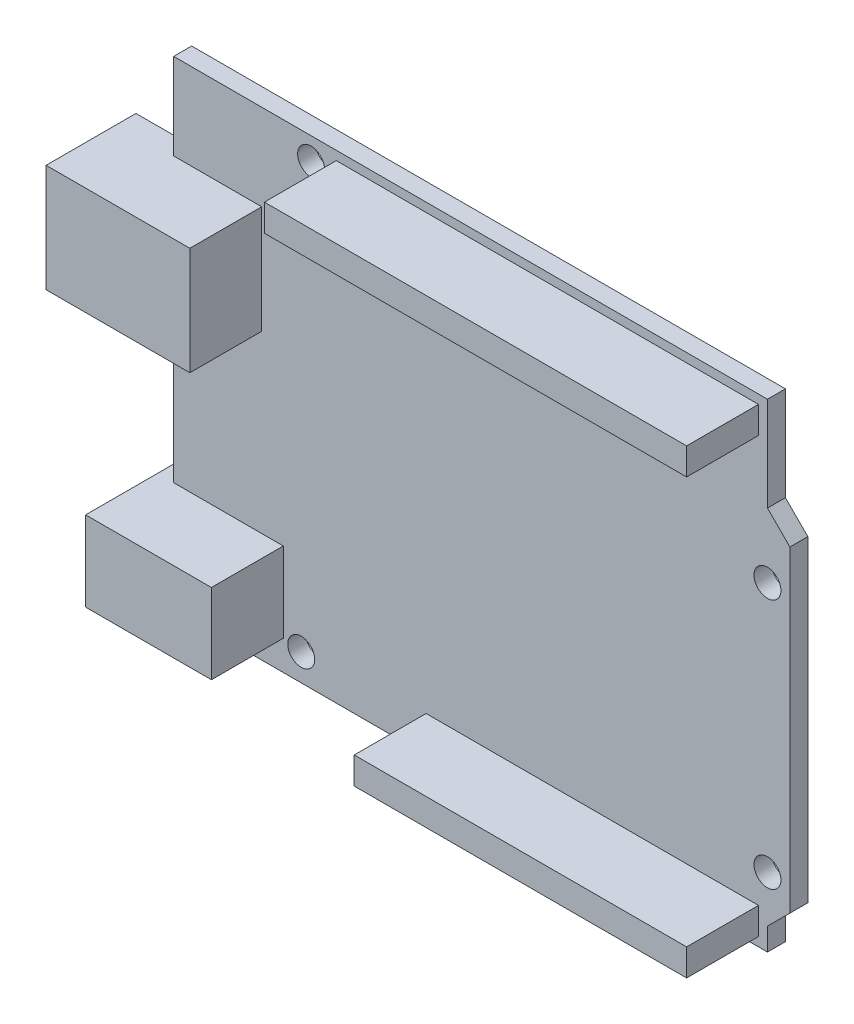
ISO-10303-21;
HEADER;
FILE_DESCRIPTION(('STEP AP214'),'2;1');
FILE_NAME('part.step','',(''),(''),'','','');
FILE_SCHEMA(('AUTOMOTIVE_DESIGN { 1 0 10303 214 1 1 1 1 }'));
ENDSEC;
DATA;
#1=APPLICATION_CONTEXT('core data for automotive mechanical design processes');
#2=APPLICATION_PROTOCOL_DEFINITION('international standard','automotive_design',2000,#1);
#3=PRODUCT_CONTEXT('',#1,'mechanical');
#4=PRODUCT('Part','Part','',(#3));
#5=PRODUCT_RELATED_PRODUCT_CATEGORY('part','',(#4));
#6=PRODUCT_DEFINITION_FORMATION('','',#4);
#7=PRODUCT_DEFINITION_CONTEXT('part definition',#1,'design');
#8=PRODUCT_DEFINITION('design','',#6,#7);
#9=PRODUCT_DEFINITION_SHAPE('','',#8);
#10=(LENGTH_UNIT() NAMED_UNIT(*) SI_UNIT(.MILLI.,.METRE.));
#11=(NAMED_UNIT(*) PLANE_ANGLE_UNIT() SI_UNIT($,.RADIAN.));
#12=(NAMED_UNIT(*) SI_UNIT($,.STERADIAN.) SOLID_ANGLE_UNIT());
#13=UNCERTAINTY_MEASURE_WITH_UNIT(LENGTH_MEASURE(1.E-05),#10,'distance_accuracy_value','');
#14=(GEOMETRIC_REPRESENTATION_CONTEXT(3) GLOBAL_UNCERTAINTY_ASSIGNED_CONTEXT((#13)) GLOBAL_UNIT_ASSIGNED_CONTEXT((#10,
#11,#12)) REPRESENTATION_CONTEXT('',''));
#15=CARTESIAN_POINT('',(0.,0.,0.));
#16=DIRECTION('',(0.,0.,1.));
#17=DIRECTION('',(1.,0.,0.));
#18=AXIS2_PLACEMENT_3D('',#15,#16,#17);
#19=CARTESIAN_POINT('',(-34.3,0.,2.));
#20=DIRECTION('',(1.,0.,0.));
#21=DIRECTION('',(0.,0.,-1.));
#22=AXIS2_PLACEMENT_3D('',#19,#20,#21);
#23=PLANE('',#22);
#24=DIRECTION('',(0.,-1.,0.));
#25=VECTOR('',#24,1.);
#26=CARTESIAN_POINT('',(-34.3,0.,0.));
#27=LINE('',#26,#25);
#28=CARTESIAN_POINT('',(-34.3,-23.35,0.));
#29=VERTEX_POINT('',#28);
#30=CARTESIAN_POINT('',(-34.3,-26.65,0.));
#31=VERTEX_POINT('',#30);
#32=EDGE_CURVE('E343',#29,#31,#27,.T.);
#33=ORIENTED_EDGE('',*,*,#32,.T.);
#34=DIRECTION('',(0.,0.,-1.));
#35=VECTOR('',#34,1.);
#36=CARTESIAN_POINT('',(-34.3,-26.65,2.));
#37=LINE('',#36,#35);
#38=CARTESIAN_POINT('',(-34.3,-26.65,2.));
#39=VERTEX_POINT('',#38);
#40=EDGE_CURVE('E48',#39,#31,#37,.T.);
#41=ORIENTED_EDGE('',*,*,#40,.F.);
#42=DIRECTION('',(0.,-1.,0.));
#43=VECTOR('',#42,1.);
#44=CARTESIAN_POINT('',(-34.3,0.,2.));
#45=LINE('',#44,#43);
#46=CARTESIAN_POINT('',(-34.3,-23.35,2.));
#47=VERTEX_POINT('',#46);
#48=EDGE_CURVE('E286',#47,#39,#45,.T.);
#49=ORIENTED_EDGE('',*,*,#48,.F.);
#50=DIRECTION('',(0.,0.,-1.));
#51=VECTOR('',#50,1.);
#52=CARTESIAN_POINT('',(-34.3,-23.35,2.));
#53=LINE('',#52,#51);
#54=EDGE_CURVE('E11',#47,#29,#53,.T.);
#55=ORIENTED_EDGE('',*,*,#54,.T.);
#56=EDGE_LOOP('',(#33,#41,#49,#55));
#57=FACE_BOUND('',#56,.T.);
#58=ADVANCED_FACE('F39',(#57),#23,.F.);
#59=CARTESIAN_POINT('',(0.,-26.65,2.));
#60=DIRECTION('',(0.,1.,0.));
#61=DIRECTION('',(-1.,0.,0.));
#62=AXIS2_PLACEMENT_3D('',#59,#60,#61);
#63=PLANE('',#62);
#64=DIRECTION('',(1.,0.,0.));
#65=VECTOR('',#64,1.);
#66=CARTESIAN_POINT('',(0.,-26.65,0.));
#67=LINE('',#66,#65);
#68=CARTESIAN_POINT('',(31.8,-26.65,0.));
#69=VERTEX_POINT('',#68);
#70=EDGE_CURVE('E346',#31,#69,#67,.T.);
#71=ORIENTED_EDGE('',*,*,#70,.T.);
#72=DIRECTION('',(0.,0.,-1.));
#73=VECTOR('',#72,1.);
#74=CARTESIAN_POINT('',(31.8,-26.65,2.));
#75=LINE('',#74,#73);
#76=CARTESIAN_POINT('',(31.8,-26.65,2.));
#77=VERTEX_POINT('',#76);
#78=EDGE_CURVE('E386',#77,#69,#75,.T.);
#79=ORIENTED_EDGE('',*,*,#78,.F.);
#80=DIRECTION('',(1.,0.,0.));
#81=VECTOR('',#80,1.);
#82=CARTESIAN_POINT('',(0.,-26.65,2.));
#83=LINE('',#82,#81);
#84=EDGE_CURVE('E109',#39,#77,#83,.T.);
#85=ORIENTED_EDGE('',*,*,#84,.F.);
#86=ORIENTED_EDGE('',*,*,#40,.T.);
#87=EDGE_LOOP('',(#71,#79,#85,#86));
#88=FACE_BOUND('',#87,.T.);
#89=ADVANCED_FACE('F388',(#88),#63,.F.);
#90=CARTESIAN_POINT('',(31.7999999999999,1.76525460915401E-13,2.));
#91=DIRECTION('',(1.,0.,0.));
#92=DIRECTION('',(0.,1.,0.));
#93=AXIS2_PLACEMENT_3D('',#90,#91,#92);
#94=PLANE('',#93);
#95=DIRECTION('',(0.,-1.,0.));
#96=VECTOR('',#95,1.);
#97=CARTESIAN_POINT('',(31.7999999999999,1.76525460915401E-13,0.));
#98=LINE('',#97,#96);
#99=CARTESIAN_POINT('',(31.8,-24.15,0.));
#100=VERTEX_POINT('',#99);
#101=EDGE_CURVE('E350',#100,#69,#98,.T.);
#102=ORIENTED_EDGE('',*,*,#101,.F.);
#103=DIRECTION('',(0.,0.,-1.));
#104=VECTOR('',#103,1.);
#105=CARTESIAN_POINT('',(31.8,-24.15,2.));
#106=LINE('',#105,#104);
#107=CARTESIAN_POINT('',(31.8,-24.15,2.));
#108=VERTEX_POINT('',#107);
#109=EDGE_CURVE('E384',#108,#100,#106,.T.);
#110=ORIENTED_EDGE('',*,*,#109,.F.);
#111=DIRECTION('',(0.,-1.,0.));
#112=VECTOR('',#111,1.);
#113=CARTESIAN_POINT('',(31.7999999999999,1.76525460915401E-13,2.));
#114=LINE('',#113,#112);
#115=EDGE_CURVE('E291',#108,#77,#114,.T.);
#116=ORIENTED_EDGE('',*,*,#115,.T.);
#117=ORIENTED_EDGE('',*,*,#78,.T.);
#118=EDGE_LOOP('',(#102,#110,#116,#117));
#119=FACE_BOUND('',#118,.T.);
#120=ADVANCED_FACE('F504',(#119),#94,.T.);
#121=CARTESIAN_POINT('',(27.9750000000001,-27.9749999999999,2.));
#122=DIRECTION('',(0.707106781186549,-0.707106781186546,0.));
#123=DIRECTION('',(0.707106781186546,0.707106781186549,0.));
#124=AXIS2_PLACEMENT_3D('',#121,#122,#123);
#125=PLANE('',#124);
#126=DIRECTION('',(-0.707106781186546,-0.707106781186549,0.));
#127=VECTOR('',#126,1.);
#128=CARTESIAN_POINT('',(27.9750000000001,-27.9749999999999,0.));
#129=LINE('',#128,#127);
#130=CARTESIAN_POINT('',(34.3,-21.65,0.));
#131=VERTEX_POINT('',#130);
#132=EDGE_CURVE('E353',#131,#100,#129,.T.);
#133=ORIENTED_EDGE('',*,*,#132,.F.);
#134=DIRECTION('',(0.,0.,-1.));
#135=VECTOR('',#134,1.);
#136=CARTESIAN_POINT('',(34.3,-21.65,2.));
#137=LINE('',#136,#135);
#138=CARTESIAN_POINT('',(34.3,-21.65,2.));
#139=VERTEX_POINT('',#138);
#140=EDGE_CURVE('E382',#139,#131,#137,.T.);
#141=ORIENTED_EDGE('',*,*,#140,.F.);
#142=DIRECTION('',(-0.707106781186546,-0.707106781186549,0.));
#143=VECTOR('',#142,1.);
#144=CARTESIAN_POINT('',(27.9750000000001,-27.9749999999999,2.));
#145=LINE('',#144,#143);
#146=EDGE_CURVE('E294',#139,#108,#145,.T.);
#147=ORIENTED_EDGE('',*,*,#146,.T.);
#148=ORIENTED_EDGE('',*,*,#109,.T.);
#149=EDGE_LOOP('',(#133,#141,#147,#148));
#150=FACE_BOUND('',#149,.T.);
#151=ADVANCED_FACE('F501',(#150),#125,.T.);
#152=CARTESIAN_POINT('',(34.3,0.,2.));
#153=DIRECTION('',(1.,0.,0.));
#154=DIRECTION('',(0.,0.,-1.));
#155=AXIS2_PLACEMENT_3D('',#152,#153,#154);
#156=PLANE('',#155);
#157=DIRECTION('',(0.,-1.,0.));
#158=VECTOR('',#157,1.);
#159=CARTESIAN_POINT('',(34.3,0.,0.));
#160=LINE('',#159,#158);
#161=CARTESIAN_POINT('',(34.3,13.65,0.));
#162=VERTEX_POINT('',#161);
#163=EDGE_CURVE('E356',#162,#131,#160,.T.);
#164=ORIENTED_EDGE('',*,*,#163,.F.);
#165=DIRECTION('',(0.,0.,-1.));
#166=VECTOR('',#165,1.);
#167=CARTESIAN_POINT('',(34.3,13.65,2.));
#168=LINE('',#167,#166);
#169=CARTESIAN_POINT('',(34.3,13.65,2.));
#170=VERTEX_POINT('',#169);
#171=EDGE_CURVE('E380',#170,#162,#168,.T.);
#172=ORIENTED_EDGE('',*,*,#171,.F.);
#173=DIRECTION('',(0.,-1.,0.));
#174=VECTOR('',#173,1.);
#175=CARTESIAN_POINT('',(34.3,0.,2.));
#176=LINE('',#175,#174);
#177=EDGE_CURVE('E297',#170,#139,#176,.T.);
#178=ORIENTED_EDGE('',*,*,#177,.T.);
#179=ORIENTED_EDGE('',*,*,#140,.T.);
#180=EDGE_LOOP('',(#164,#172,#178,#179));
#181=FACE_BOUND('',#180,.T.);
#182=ADVANCED_FACE('F497',(#181),#156,.T.);
#183=CARTESIAN_POINT('',(23.9749999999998,23.9750000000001,2.));
#184=DIRECTION('',(0.707106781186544,0.707106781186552,0.));
#185=DIRECTION('',(-0.707106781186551,0.707106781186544,0.));
#186=AXIS2_PLACEMENT_3D('',#183,#184,#185);
#187=PLANE('',#186);
#188=DIRECTION('',(0.707106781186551,-0.707106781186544,0.));
#189=VECTOR('',#188,1.);
#190=CARTESIAN_POINT('',(23.9749999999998,23.9750000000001,0.));
#191=LINE('',#190,#189);
#192=CARTESIAN_POINT('',(31.8,16.15,0.));
#193=VERTEX_POINT('',#192);
#194=EDGE_CURVE('E359',#193,#162,#191,.T.);
#195=ORIENTED_EDGE('',*,*,#194,.F.);
#196=DIRECTION('',(0.,0.,-1.));
#197=VECTOR('',#196,1.);
#198=CARTESIAN_POINT('',(31.8,16.15,2.));
#199=LINE('',#198,#197);
#200=CARTESIAN_POINT('',(31.8,16.15,2.));
#201=VERTEX_POINT('',#200);
#202=EDGE_CURVE('E378',#201,#193,#199,.T.);
#203=ORIENTED_EDGE('',*,*,#202,.F.);
#204=DIRECTION('',(0.707106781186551,-0.707106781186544,0.));
#205=VECTOR('',#204,1.);
#206=CARTESIAN_POINT('',(23.9749999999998,23.9750000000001,2.));
#207=LINE('',#206,#205);
#208=EDGE_CURVE('E300',#201,#170,#207,.T.);
#209=ORIENTED_EDGE('',*,*,#208,.T.);
#210=ORIENTED_EDGE('',*,*,#171,.T.);
#211=EDGE_LOOP('',(#195,#203,#209,#210));
#212=FACE_BOUND('',#211,.T.);
#213=ADVANCED_FACE('F493',(#212),#187,.T.);
#214=CARTESIAN_POINT('',(31.8,0.,2.));
#215=DIRECTION('',(1.,0.,0.));
#216=DIRECTION('',(0.,0.,-1.));
#217=AXIS2_PLACEMENT_3D('',#214,#215,#216);
#218=PLANE('',#217);
#219=DIRECTION('',(0.,-1.,0.));
#220=VECTOR('',#219,1.);
#221=CARTESIAN_POINT('',(31.8,0.,0.));
#222=LINE('',#221,#220);
#223=CARTESIAN_POINT('',(31.8,26.65,0.));
#224=VERTEX_POINT('',#223);
#225=EDGE_CURVE('E362',#224,#193,#222,.T.);
#226=ORIENTED_EDGE('',*,*,#225,.F.);
#227=DIRECTION('',(0.,0.,-1.));
#228=VECTOR('',#227,1.);
#229=CARTESIAN_POINT('',(31.8,26.65,2.));
#230=LINE('',#229,#228);
#231=CARTESIAN_POINT('',(31.8,26.65,2.));
#232=VERTEX_POINT('',#231);
#233=EDGE_CURVE('E376',#232,#224,#230,.T.);
#234=ORIENTED_EDGE('',*,*,#233,.F.);
#235=DIRECTION('',(0.,-1.,0.));
#236=VECTOR('',#235,1.);
#237=CARTESIAN_POINT('',(31.8,0.,2.));
#238=LINE('',#237,#236);
#239=EDGE_CURVE('E303',#232,#201,#238,.T.);
#240=ORIENTED_EDGE('',*,*,#239,.T.);
#241=ORIENTED_EDGE('',*,*,#202,.T.);
#242=EDGE_LOOP('',(#226,#234,#240,#241));
#243=FACE_BOUND('',#242,.T.);
#244=ADVANCED_FACE('F489',(#243),#218,.T.);
#245=CARTESIAN_POINT('',(0.,26.65,2.));
#246=DIRECTION('',(0.,1.,0.));
#247=DIRECTION('',(-1.,0.,0.));
#248=AXIS2_PLACEMENT_3D('',#245,#246,#247);
#249=PLANE('',#248);
#250=DIRECTION('',(1.,0.,0.));
#251=VECTOR('',#250,1.);
#252=CARTESIAN_POINT('',(0.,26.65,0.));
#253=LINE('',#252,#251);
#254=CARTESIAN_POINT('',(-34.3,26.65,0.));
#255=VERTEX_POINT('',#254);
#256=EDGE_CURVE('E365',#255,#224,#253,.T.);
#257=ORIENTED_EDGE('',*,*,#256,.F.);
#258=DIRECTION('',(0.,0.,-1.));
#259=VECTOR('',#258,1.);
#260=CARTESIAN_POINT('',(-34.3,26.65,2.));
#261=LINE('',#260,#259);
#262=CARTESIAN_POINT('',(-34.3,26.65,2.));
#263=VERTEX_POINT('',#262);
#264=EDGE_CURVE('E374',#263,#255,#261,.T.);
#265=ORIENTED_EDGE('',*,*,#264,.F.);
#266=DIRECTION('',(1.,0.,0.));
#267=VECTOR('',#266,1.);
#268=CARTESIAN_POINT('',(0.,26.65,2.));
#269=LINE('',#268,#267);
#270=EDGE_CURVE('E306',#263,#232,#269,.T.);
#271=ORIENTED_EDGE('',*,*,#270,.T.);
#272=ORIENTED_EDGE('',*,*,#233,.T.);
#273=EDGE_LOOP('',(#257,#265,#271,#272));
#274=FACE_BOUND('',#273,.T.);
#275=ADVANCED_FACE('F484',(#274),#249,.T.);
#276=CARTESIAN_POINT('',(-34.3,17.05,0.));
#277=VERTEX_POINT('',#276);
#278=EDGE_CURVE('E347',#255,#277,#27,.T.);
#279=ORIENTED_EDGE('',*,*,#278,.T.);
#280=DIRECTION('',(0.,0.,-1.));
#281=VECTOR('',#280,1.);
#282=CARTESIAN_POINT('',(-34.3,17.05,2.));
#283=LINE('',#282,#281);
#284=CARTESIAN_POINT('',(-34.3,17.05,2.));
#285=VERTEX_POINT('',#284);
#286=EDGE_CURVE('E372',#285,#277,#283,.T.);
#287=ORIENTED_EDGE('',*,*,#286,.F.);
#288=EDGE_CURVE('E289',#263,#285,#45,.T.);
#289=ORIENTED_EDGE('',*,*,#288,.F.);
#290=ORIENTED_EDGE('',*,*,#264,.T.);
#291=EDGE_LOOP('',(#279,#287,#289,#290));
#292=FACE_BOUND('',#291,.T.);
#293=ADVANCED_FACE('F480',(#292),#23,.F.);
#294=CARTESIAN_POINT('',(-34.3,5.04999999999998,0.));
#295=VERTEX_POINT('',#294);
#296=CARTESIAN_POINT('',(-34.3,-14.45,0.));
#297=VERTEX_POINT('',#296);
#298=EDGE_CURVE('E268',#295,#297,#27,.T.);
#299=ORIENTED_EDGE('',*,*,#298,.T.);
#300=DIRECTION('',(0.,0.,-1.));
#301=VECTOR('',#300,1.);
#302=CARTESIAN_POINT('',(-34.3,-14.45,2.));
#303=LINE('',#302,#301);
#304=CARTESIAN_POINT('',(-34.3,-14.45,2.));
#305=VERTEX_POINT('',#304);
#306=EDGE_CURVE('E331',#305,#297,#303,.T.);
#307=ORIENTED_EDGE('',*,*,#306,.F.);
#308=CARTESIAN_POINT('',(-34.3,5.04999999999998,2.));
#309=VERTEX_POINT('',#308);
#310=EDGE_CURVE('E288',#309,#305,#45,.T.);
#311=ORIENTED_EDGE('',*,*,#310,.F.);
#312=DIRECTION('',(0.,0.,-1.));
#313=VECTOR('',#312,1.);
#314=CARTESIAN_POINT('',(-34.3,5.04999999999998,2.));
#315=LINE('',#314,#313);
#316=EDGE_CURVE('E369',#309,#295,#315,.T.);
#317=ORIENTED_EDGE('',*,*,#316,.T.);
#318=EDGE_LOOP('',(#299,#307,#311,#317));
#319=FACE_BOUND('',#318,.T.);
#320=ADVANCED_FACE('F455',(#319),#23,.F.);
#321=CARTESIAN_POINT('',(-19.,24.15,2.));
#322=DIRECTION('',(0.,0.,-1.));
#323=DIRECTION('',(-1.,0.,0.));
#324=AXIS2_PLACEMENT_3D('',#321,#322,#323);
#325=CYLINDRICAL_SURFACE('',#324,1.5);
#326=CARTESIAN_POINT('',(-19.,24.15,2.));
#327=DIRECTION('',(0.,0.,1.));
#328=DIRECTION('',(1.,0.,0.));
#329=AXIS2_PLACEMENT_3D('',#326,#327,#328);
#330=CIRCLE('',#329,1.5);
#331=CARTESIAN_POINT('',(-17.5,24.15,2.));
#332=VERTEX_POINT('',#331);
#333=EDGE_CURVE('E274',#332,#332,#330,.T.);
#334=ORIENTED_EDGE('',*,*,#333,.T.);
#335=EDGE_LOOP('',(#334));
#336=FACE_BOUND('',#335,.T.);
#337=CARTESIAN_POINT('',(-19.,24.15,0.));
#338=DIRECTION('',(0.,0.,1.));
#339=DIRECTION('',(1.,0.,0.));
#340=AXIS2_PLACEMENT_3D('',#337,#338,#339);
#341=CIRCLE('',#340,1.5);
#342=CARTESIAN_POINT('',(-17.5,24.15,0.));
#343=VERTEX_POINT('',#342);
#344=EDGE_CURVE('E340',#343,#343,#341,.T.);
#345=ORIENTED_EDGE('',*,*,#344,.F.);
#346=EDGE_LOOP('',(#345));
#347=FACE_BOUND('',#346,.T.);
#348=ADVANCED_FACE('F562',(#336,#347),#325,.F.);
#349=CARTESIAN_POINT('',(31.8,8.94999999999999,2.));
#350=DIRECTION('',(0.,0.,-1.));
#351=DIRECTION('',(-1.,0.,0.));
#352=AXIS2_PLACEMENT_3D('',#349,#350,#351);
#353=CYLINDRICAL_SURFACE('',#352,1.5);
#354=CARTESIAN_POINT('',(31.8,8.94999999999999,2.));
#355=DIRECTION('',(0.,0.,1.));
#356=DIRECTION('',(1.,0.,0.));
#357=AXIS2_PLACEMENT_3D('',#354,#355,#356);
#358=CIRCLE('',#357,1.5);
#359=CARTESIAN_POINT('',(33.3,8.94999999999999,2.));
#360=VERTEX_POINT('',#359);
#361=EDGE_CURVE('E271',#360,#360,#358,.T.);
#362=ORIENTED_EDGE('',*,*,#361,.T.);
#363=EDGE_LOOP('',(#362));
#364=FACE_BOUND('',#363,.T.);
#365=CARTESIAN_POINT('',(31.8,8.94999999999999,0.));
#366=DIRECTION('',(0.,0.,1.));
#367=DIRECTION('',(1.,0.,0.));
#368=AXIS2_PLACEMENT_3D('',#365,#366,#367);
#369=CIRCLE('',#368,1.5);
#370=CARTESIAN_POINT('',(33.3,8.94999999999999,0.));
#371=VERTEX_POINT('',#370);
#372=EDGE_CURVE('E337',#371,#371,#369,.T.);
#373=ORIENTED_EDGE('',*,*,#372,.F.);
#374=EDGE_LOOP('',(#373));
#375=FACE_BOUND('',#374,.T.);
#376=ADVANCED_FACE('F567',(#364,#375),#353,.F.);
#377=CARTESIAN_POINT('',(31.8,-18.95,2.));
#378=DIRECTION('',(0.,0.,-1.));
#379=DIRECTION('',(-1.,0.,0.));
#380=AXIS2_PLACEMENT_3D('',#377,#378,#379);
#381=CYLINDRICAL_SURFACE('',#380,1.5);
#382=CARTESIAN_POINT('',(31.8,-18.95,2.));
#383=DIRECTION('',(0.,0.,1.));
#384=DIRECTION('',(1.,0.,0.));
#385=AXIS2_PLACEMENT_3D('',#382,#383,#384);
#386=CIRCLE('',#385,1.5);
#387=CARTESIAN_POINT('',(33.3,-18.95,2.));
#388=VERTEX_POINT('',#387);
#389=EDGE_CURVE('E267',#388,#388,#386,.T.);
#390=ORIENTED_EDGE('',*,*,#389,.T.);
#391=EDGE_LOOP('',(#390));
#392=FACE_BOUND('',#391,.T.);
#393=CARTESIAN_POINT('',(31.8,-18.95,0.));
#394=DIRECTION('',(0.,0.,1.));
#395=DIRECTION('',(1.,0.,0.));
#396=AXIS2_PLACEMENT_3D('',#393,#394,#395);
#397=CIRCLE('',#396,1.5);
#398=CARTESIAN_POINT('',(33.3,-18.95,0.));
#399=VERTEX_POINT('',#398);
#400=EDGE_CURVE('E334',#399,#399,#397,.T.);
#401=ORIENTED_EDGE('',*,*,#400,.F.);
#402=EDGE_LOOP('',(#401));
#403=FACE_BOUND('',#402,.T.);
#404=ADVANCED_FACE('F574',(#392,#403),#381,.F.);
#405=CARTESIAN_POINT('',(-20.1,-23.65,2.));
#406=DIRECTION('',(0.,0.,-1.));
#407=DIRECTION('',(-1.,0.,0.));
#408=AXIS2_PLACEMENT_3D('',#405,#406,#407);
#409=CYLINDRICAL_SURFACE('',#408,1.5);
#410=CARTESIAN_POINT('',(-20.1,-23.65,2.));
#411=DIRECTION('',(0.,0.,1.));
#412=DIRECTION('',(1.,0.,0.));
#413=AXIS2_PLACEMENT_3D('',#410,#411,#412);
#414=CIRCLE('',#413,1.5);
#415=CARTESIAN_POINT('',(-18.6,-23.65,2.));
#416=VERTEX_POINT('',#415);
#417=EDGE_CURVE('E264',#416,#416,#414,.T.);
#418=ORIENTED_EDGE('',*,*,#417,.T.);
#419=EDGE_LOOP('',(#418));
#420=FACE_BOUND('',#419,.T.);
#421=CARTESIAN_POINT('',(-20.1,-23.65,0.));
#422=DIRECTION('',(0.,0.,1.));
#423=DIRECTION('',(1.,0.,0.));
#424=AXIS2_PLACEMENT_3D('',#421,#422,#423);
#425=CIRCLE('',#424,1.5);
#426=CARTESIAN_POINT('',(-18.6,-23.65,0.));
#427=VERTEX_POINT('',#426);
#428=EDGE_CURVE('E263',#427,#427,#425,.T.);
#429=ORIENTED_EDGE('',*,*,#428,.F.);
#430=EDGE_LOOP('',(#429));
#431=FACE_BOUND('',#430,.T.);
#432=ADVANCED_FACE('F41',(#420,#431),#409,.F.);
#433=CARTESIAN_POINT('',(0.,0.,2.));
#434=DIRECTION('',(0.,0.,1.));
#435=DIRECTION('',(1.,0.,0.));
#436=AXIS2_PLACEMENT_3D('',#433,#434,#435);
#437=PLANE('',#436);
#438=ORIENTED_EDGE('',*,*,#417,.F.);
#439=EDGE_LOOP('',(#438));
#440=FACE_BOUND('',#439,.T.);
#441=ORIENTED_EDGE('',*,*,#389,.F.);
#442=EDGE_LOOP('',(#441));
#443=FACE_BOUND('',#442,.T.);
#444=ORIENTED_EDGE('',*,*,#361,.F.);
#445=EDGE_LOOP('',(#444));
#446=FACE_BOUND('',#445,.T.);
#447=ORIENTED_EDGE('',*,*,#333,.F.);
#448=EDGE_LOOP('',(#447));
#449=FACE_BOUND('',#448,.T.);
#450=DIRECTION('',(-1.,0.,0.));
#451=VECTOR('',#450,1.);
#452=CARTESIAN_POINT('',(0.,-14.45,2.));
#453=LINE('',#452,#451);
#454=CARTESIAN_POINT('',(-22.1,-14.45,2.));
#455=VERTEX_POINT('',#454);
#456=EDGE_CURVE('E277',#455,#305,#453,.T.);
#457=ORIENTED_EDGE('',*,*,#456,.F.);
#458=DIRECTION('',(0.,1.,0.));
#459=VECTOR('',#458,1.);
#460=CARTESIAN_POINT('',(-22.1,0.,2.));
#461=LINE('',#460,#459);
#462=CARTESIAN_POINT('',(-22.1,-23.35,2.));
#463=VERTEX_POINT('',#462);
#464=EDGE_CURVE('E280',#463,#455,#461,.T.);
#465=ORIENTED_EDGE('',*,*,#464,.F.);
#466=DIRECTION('',(-1.,0.,0.));
#467=VECTOR('',#466,1.);
#468=CARTESIAN_POINT('',(0.,-23.35,2.));
#469=LINE('',#468,#467);
#470=EDGE_CURVE('E283',#463,#47,#469,.T.);
#471=ORIENTED_EDGE('',*,*,#470,.T.);
#472=ORIENTED_EDGE('',*,*,#48,.T.);
#473=ORIENTED_EDGE('',*,*,#84,.T.);
#474=ORIENTED_EDGE('',*,*,#115,.F.);
#475=ORIENTED_EDGE('',*,*,#146,.F.);
#476=ORIENTED_EDGE('',*,*,#177,.F.);
#477=ORIENTED_EDGE('',*,*,#208,.F.);
#478=ORIENTED_EDGE('',*,*,#239,.F.);
#479=ORIENTED_EDGE('',*,*,#270,.F.);
#480=ORIENTED_EDGE('',*,*,#288,.T.);
#481=DIRECTION('',(-1.,0.,0.));
#482=VECTOR('',#481,1.);
#483=CARTESIAN_POINT('',(0.,17.05,2.));
#484=LINE('',#483,#482);
#485=CARTESIAN_POINT('',(-24.5,17.05,2.));
#486=VERTEX_POINT('',#485);
#487=EDGE_CURVE('E309',#486,#285,#484,.T.);
#488=ORIENTED_EDGE('',*,*,#487,.F.);
#489=DIRECTION('',(0.,1.,0.));
#490=VECTOR('',#489,1.);
#491=CARTESIAN_POINT('',(-24.5,0.,2.));
#492=LINE('',#491,#490);
#493=CARTESIAN_POINT('',(-24.5,5.04999999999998,2.));
#494=VERTEX_POINT('',#493);
#495=EDGE_CURVE('E312',#494,#486,#492,.T.);
#496=ORIENTED_EDGE('',*,*,#495,.F.);
#497=DIRECTION('',(-1.,0.,0.));
#498=VECTOR('',#497,1.);
#499=CARTESIAN_POINT('',(0.,5.04999999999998,2.));
#500=LINE('',#499,#498);
#501=EDGE_CURVE('E315',#494,#309,#500,.T.);
#502=ORIENTED_EDGE('',*,*,#501,.T.);
#503=ORIENTED_EDGE('',*,*,#310,.T.);
#504=EDGE_LOOP('',(#457,#465,#471,#472,#473,#474,#475,#476,#477,#478,#479,#480,#488,#496,#502,#503));
#505=FACE_BOUND('',#504,.T.);
#506=DIRECTION('',(0.,-1.,0.));
#507=VECTOR('',#506,1.);
#508=CARTESIAN_POINT('',(-16.2,0.,2.));
#509=LINE('',#508,#507);
#510=CARTESIAN_POINT('',(-16.2,25.65,2.));
#511=VERTEX_POINT('',#510);
#512=CARTESIAN_POINT('',(-16.2,22.65,2.));
#513=VERTEX_POINT('',#512);
#514=EDGE_CURVE('E318',#511,#513,#509,.T.);
#515=ORIENTED_EDGE('',*,*,#514,.F.);
#516=DIRECTION('',(-1.,0.,0.));
#517=VECTOR('',#516,1.);
#518=CARTESIAN_POINT('',(0.,25.65,2.));
#519=LINE('',#518,#517);
#520=CARTESIAN_POINT('',(30.8,25.65,2.));
#521=VERTEX_POINT('',#520);
#522=EDGE_CURVE('E321',#521,#511,#519,.T.);
#523=ORIENTED_EDGE('',*,*,#522,.F.);
#524=DIRECTION('',(0.,-1.,0.));
#525=VECTOR('',#524,1.);
#526=CARTESIAN_POINT('',(30.8,0.,2.));
#527=LINE('',#526,#525);
#528=CARTESIAN_POINT('',(30.8,22.65,2.));
#529=VERTEX_POINT('',#528);
#530=EDGE_CURVE('E324',#521,#529,#527,.T.);
#531=ORIENTED_EDGE('',*,*,#530,.T.);
#532=DIRECTION('',(-1.,0.,0.));
#533=VECTOR('',#532,1.);
#534=CARTESIAN_POINT('',(0.,22.65,2.));
#535=LINE('',#534,#533);
#536=EDGE_CURVE('E144',#529,#513,#535,.T.);
#537=ORIENTED_EDGE('',*,*,#536,.T.);
#538=EDGE_LOOP('',(#515,#523,#531,#537));
#539=FACE_BOUND('',#538,.T.);
#540=DIRECTION('',(0.,-1.,0.));
#541=VECTOR('',#540,1.);
#542=CARTESIAN_POINT('',(-6.19999999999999,0.,2.));
#543=LINE('',#542,#541);
#544=CARTESIAN_POINT('',(-6.2,-22.65,2.));
#545=VERTEX_POINT('',#544);
#546=CARTESIAN_POINT('',(-6.2,-25.65,2.));
#547=VERTEX_POINT('',#546);
#548=EDGE_CURVE('E135',#545,#547,#543,.T.);
#549=ORIENTED_EDGE('',*,*,#548,.F.);
#550=DIRECTION('',(-1.,0.,0.));
#551=VECTOR('',#550,1.);
#552=CARTESIAN_POINT('',(0.,-22.65,2.));
#553=LINE('',#552,#551);
#554=CARTESIAN_POINT('',(30.8,-22.65,2.));
#555=VERTEX_POINT('',#554);
#556=EDGE_CURVE('E138',#555,#545,#553,.T.);
#557=ORIENTED_EDGE('',*,*,#556,.F.);
#558=DIRECTION('',(0.,1.,0.));
#559=VECTOR('',#558,1.);
#560=CARTESIAN_POINT('',(30.8,0.,2.));
#561=LINE('',#560,#559);
#562=CARTESIAN_POINT('',(30.8,-25.65,2.));
#563=VERTEX_POINT('',#562);
#564=EDGE_CURVE('E156',#563,#555,#561,.T.);
#565=ORIENTED_EDGE('',*,*,#564,.F.);
#566=DIRECTION('',(1.,0.,0.));
#567=VECTOR('',#566,1.);
#568=CARTESIAN_POINT('',(0.,-25.65,2.));
#569=LINE('',#568,#567);
#570=EDGE_CURVE('E56',#547,#563,#569,.T.);
#571=ORIENTED_EDGE('',*,*,#570,.F.);
#572=EDGE_LOOP('',(#549,#557,#565,#571));
#573=FACE_BOUND('',#572,.T.);
#574=ADVANCED_FACE('F137',(#440,#443,#446,#449,#505,#539,#573),#437,.T.);
#575=CARTESIAN_POINT('',(0.,0.,0.));
#576=DIRECTION('',(0.,0.,1.));
#577=DIRECTION('',(1.,0.,0.));
#578=AXIS2_PLACEMENT_3D('',#575,#576,#577);
#579=PLANE('',#578);
#580=ORIENTED_EDGE('',*,*,#32,.F.);
#581=DIRECTION('',(-1.,0.,0.));
#582=VECTOR('',#581,1.);
#583=CARTESIAN_POINT('',(0.,-23.35,0.));
#584=LINE('',#583,#582);
#585=CARTESIAN_POINT('',(-36.1,-23.35,0.));
#586=VERTEX_POINT('',#585);
#587=EDGE_CURVE('E196',#29,#586,#584,.T.);
#588=ORIENTED_EDGE('',*,*,#587,.T.);
#589=DIRECTION('',(0.,1.,0.));
#590=VECTOR('',#589,1.);
#591=CARTESIAN_POINT('',(-36.1,0.,0.));
#592=LINE('',#591,#590);
#593=CARTESIAN_POINT('',(-36.1,-14.45,0.));
#594=VERTEX_POINT('',#593);
#595=EDGE_CURVE('E192',#586,#594,#592,.T.);
#596=ORIENTED_EDGE('',*,*,#595,.T.);
#597=DIRECTION('',(-1.,0.,0.));
#598=VECTOR('',#597,1.);
#599=CARTESIAN_POINT('',(0.,-14.45,0.));
#600=LINE('',#599,#598);
#601=EDGE_CURVE('E100',#297,#594,#600,.T.);
#602=ORIENTED_EDGE('',*,*,#601,.F.);
#603=ORIENTED_EDGE('',*,*,#298,.F.);
#604=DIRECTION('',(-1.,0.,0.));
#605=VECTOR('',#604,1.);
#606=CARTESIAN_POINT('',(0.,5.04999999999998,0.));
#607=LINE('',#606,#605);
#608=CARTESIAN_POINT('',(-40.5,5.04999999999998,0.));
#609=VERTEX_POINT('',#608);
#610=EDGE_CURVE('E232',#295,#609,#607,.T.);
#611=ORIENTED_EDGE('',*,*,#610,.T.);
#612=DIRECTION('',(0.,-1.,0.));
#613=VECTOR('',#612,1.);
#614=CARTESIAN_POINT('',(-40.5,0.,0.));
#615=LINE('',#614,#613);
#616=CARTESIAN_POINT('',(-40.5,17.05,0.));
#617=VERTEX_POINT('',#616);
#618=EDGE_CURVE('E237',#617,#609,#615,.T.);
#619=ORIENTED_EDGE('',*,*,#618,.F.);
#620=DIRECTION('',(-1.,0.,0.));
#621=VECTOR('',#620,1.);
#622=CARTESIAN_POINT('',(0.,17.05,0.));
#623=LINE('',#622,#621);
#624=EDGE_CURVE('E93',#277,#617,#623,.T.);
#625=ORIENTED_EDGE('',*,*,#624,.F.);
#626=ORIENTED_EDGE('',*,*,#278,.F.);
#627=ORIENTED_EDGE('',*,*,#256,.T.);
#628=ORIENTED_EDGE('',*,*,#225,.T.);
#629=ORIENTED_EDGE('',*,*,#194,.T.);
#630=ORIENTED_EDGE('',*,*,#163,.T.);
#631=ORIENTED_EDGE('',*,*,#132,.T.);
#632=ORIENTED_EDGE('',*,*,#101,.T.);
#633=ORIENTED_EDGE('',*,*,#70,.F.);
#634=EDGE_LOOP('',(#580,#588,#596,#602,#603,#611,#619,#625,#626,#627,#628,#629,#630,#631,#632,#633));
#635=FACE_BOUND('',#634,.T.);
#636=ORIENTED_EDGE('',*,*,#428,.T.);
#637=EDGE_LOOP('',(#636));
#638=FACE_BOUND('',#637,.T.);
#639=ORIENTED_EDGE('',*,*,#400,.T.);
#640=EDGE_LOOP('',(#639));
#641=FACE_BOUND('',#640,.T.);
#642=ORIENTED_EDGE('',*,*,#372,.T.);
#643=EDGE_LOOP('',(#642));
#644=FACE_BOUND('',#643,.T.);
#645=ORIENTED_EDGE('',*,*,#344,.T.);
#646=EDGE_LOOP('',(#645));
#647=FACE_BOUND('',#646,.T.);
#648=ADVANCED_FACE('F394',(#635,#638,#641,#644,#647),#579,.F.);
#649=CARTESIAN_POINT('',(0.,5.04999999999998,10.));
#650=DIRECTION('',(0.,-1.,0.));
#651=DIRECTION('',(0.,0.,-1.));
#652=AXIS2_PLACEMENT_3D('',#649,#650,#651);
#653=PLANE('',#652);
#654=ORIENTED_EDGE('',*,*,#316,.F.);
#655=ORIENTED_EDGE('',*,*,#501,.F.);
#656=DIRECTION('',(0.,0.,-1.));
#657=VECTOR('',#656,1.);
#658=CARTESIAN_POINT('',(-24.5,5.04999999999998,10.));
#659=LINE('',#658,#657);
#660=CARTESIAN_POINT('',(-24.5,5.04999999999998,10.));
#661=VERTEX_POINT('',#660);
#662=EDGE_CURVE('E260',#661,#494,#659,.T.);
#663=ORIENTED_EDGE('',*,*,#662,.F.);
#664=DIRECTION('',(-1.,0.,0.));
#665=VECTOR('',#664,1.);
#666=CARTESIAN_POINT('',(0.,5.04999999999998,10.));
#667=LINE('',#666,#665);
#668=CARTESIAN_POINT('',(-40.5,5.04999999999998,10.));
#669=VERTEX_POINT('',#668);
#670=EDGE_CURVE('E233',#661,#669,#667,.T.);
#671=ORIENTED_EDGE('',*,*,#670,.T.);
#672=DIRECTION('',(0.,0.,-1.));
#673=VECTOR('',#672,1.);
#674=CARTESIAN_POINT('',(-40.5,5.04999999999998,10.));
#675=LINE('',#674,#673);
#676=EDGE_CURVE('E246',#669,#609,#675,.T.);
#677=ORIENTED_EDGE('',*,*,#676,.T.);
#678=ORIENTED_EDGE('',*,*,#610,.F.);
#679=EDGE_LOOP('',(#654,#655,#663,#671,#677,#678));
#680=FACE_BOUND('',#679,.T.);
#681=ADVANCED_FACE('F450',(#680),#653,.T.);
#682=CARTESIAN_POINT('',(0.,17.05,10.));
#683=DIRECTION('',(0.,-1.,0.));
#684=DIRECTION('',(0.,0.,-1.));
#685=AXIS2_PLACEMENT_3D('',#682,#683,#684);
#686=PLANE('',#685);
#687=ORIENTED_EDGE('',*,*,#487,.T.);
#688=ORIENTED_EDGE('',*,*,#286,.T.);
#689=ORIENTED_EDGE('',*,*,#624,.T.);
#690=DIRECTION('',(0.,0.,-1.));
#691=VECTOR('',#690,1.);
#692=CARTESIAN_POINT('',(-40.5,17.05,10.));
#693=LINE('',#692,#691);
#694=CARTESIAN_POINT('',(-40.5,17.05,10.));
#695=VERTEX_POINT('',#694);
#696=EDGE_CURVE('E254',#695,#617,#693,.T.);
#697=ORIENTED_EDGE('',*,*,#696,.F.);
#698=DIRECTION('',(-1.,0.,0.));
#699=VECTOR('',#698,1.);
#700=CARTESIAN_POINT('',(0.,17.05,10.));
#701=LINE('',#700,#699);
#702=CARTESIAN_POINT('',(-24.5,17.05,10.));
#703=VERTEX_POINT('',#702);
#704=EDGE_CURVE('E240',#703,#695,#701,.T.);
#705=ORIENTED_EDGE('',*,*,#704,.F.);
#706=DIRECTION('',(0.,0.,-1.));
#707=VECTOR('',#706,1.);
#708=CARTESIAN_POINT('',(-24.5,17.05,10.));
#709=LINE('',#708,#707);
#710=EDGE_CURVE('E257',#703,#486,#709,.T.);
#711=ORIENTED_EDGE('',*,*,#710,.T.);
#712=EDGE_LOOP('',(#687,#688,#689,#697,#705,#711));
#713=FACE_BOUND('',#712,.T.);
#714=ADVANCED_FACE('F468',(#713),#686,.F.);
#715=CARTESIAN_POINT('',(-24.5,0.,10.));
#716=DIRECTION('',(-1.,0.,0.));
#717=DIRECTION('',(0.,0.,1.));
#718=AXIS2_PLACEMENT_3D('',#715,#716,#717);
#719=PLANE('',#718);
#720=ORIENTED_EDGE('',*,*,#495,.T.);
#721=ORIENTED_EDGE('',*,*,#710,.F.);
#722=DIRECTION('',(0.,1.,0.));
#723=VECTOR('',#722,1.);
#724=CARTESIAN_POINT('',(-24.5,0.,10.));
#725=LINE('',#724,#723);
#726=EDGE_CURVE('E236',#661,#703,#725,.T.);
#727=ORIENTED_EDGE('',*,*,#726,.F.);
#728=ORIENTED_EDGE('',*,*,#662,.T.);
#729=EDGE_LOOP('',(#720,#721,#727,#728));
#730=FACE_BOUND('',#729,.T.);
#731=ADVANCED_FACE('F464',(#730),#719,.F.);
#732=CARTESIAN_POINT('',(-40.5,0.,10.));
#733=DIRECTION('',(1.,0.,0.));
#734=DIRECTION('',(0.,0.,-1.));
#735=AXIS2_PLACEMENT_3D('',#732,#733,#734);
#736=PLANE('',#735);
#737=ORIENTED_EDGE('',*,*,#618,.T.);
#738=ORIENTED_EDGE('',*,*,#676,.F.);
#739=DIRECTION('',(0.,-1.,0.));
#740=VECTOR('',#739,1.);
#741=CARTESIAN_POINT('',(-40.5,0.,10.));
#742=LINE('',#741,#740);
#743=EDGE_CURVE('E243',#695,#669,#742,.T.);
#744=ORIENTED_EDGE('',*,*,#743,.F.);
#745=ORIENTED_EDGE('',*,*,#696,.T.);
#746=EDGE_LOOP('',(#737,#738,#744,#745));
#747=FACE_BOUND('',#746,.T.);
#748=ADVANCED_FACE('F476',(#747),#736,.F.);
#749=CARTESIAN_POINT('',(0.,0.,10.));
#750=DIRECTION('',(0.,0.,1.));
#751=DIRECTION('',(1.,0.,0.));
#752=AXIS2_PLACEMENT_3D('',#749,#750,#751);
#753=PLANE('',#752);
#754=ORIENTED_EDGE('',*,*,#670,.F.);
#755=ORIENTED_EDGE('',*,*,#726,.T.);
#756=ORIENTED_EDGE('',*,*,#704,.T.);
#757=ORIENTED_EDGE('',*,*,#743,.T.);
#758=EDGE_LOOP('',(#754,#755,#756,#757));
#759=FACE_BOUND('',#758,.T.);
#760=ADVANCED_FACE('F473',(#759),#753,.T.);
#761=CARTESIAN_POINT('',(0.,25.65,10.));
#762=DIRECTION('',(0.,-1.,0.));
#763=DIRECTION('',(0.,0.,-1.));
#764=AXIS2_PLACEMENT_3D('',#761,#762,#763);
#765=PLANE('',#764);
#766=ORIENTED_EDGE('',*,*,#522,.T.);
#767=DIRECTION('',(0.,0.,-1.));
#768=VECTOR('',#767,1.);
#769=CARTESIAN_POINT('',(-16.2,25.65,10.));
#770=LINE('',#769,#768);
#771=CARTESIAN_POINT('',(-16.2,25.65,10.));
#772=VERTEX_POINT('',#771);
#773=EDGE_CURVE('E199',#772,#511,#770,.T.);
#774=ORIENTED_EDGE('',*,*,#773,.F.);
#775=DIRECTION('',(-1.,0.,0.));
#776=VECTOR('',#775,1.);
#777=CARTESIAN_POINT('',(0.,25.65,10.));
#778=LINE('',#777,#776);
#779=CARTESIAN_POINT('',(30.8,25.65,10.));
#780=VERTEX_POINT('',#779);
#781=EDGE_CURVE('E229',#780,#772,#778,.T.);
#782=ORIENTED_EDGE('',*,*,#781,.F.);
#783=DIRECTION('',(0.,0.,-1.));
#784=VECTOR('',#783,1.);
#785=CARTESIAN_POINT('',(30.8,25.65,10.));
#786=LINE('',#785,#784);
#787=EDGE_CURVE('E217',#780,#521,#786,.T.);
#788=ORIENTED_EDGE('',*,*,#787,.T.);
#789=EDGE_LOOP('',(#766,#774,#782,#788));
#790=FACE_BOUND('',#789,.T.);
#791=ADVANCED_FACE('F609',(#790),#765,.F.);
#792=CARTESIAN_POINT('',(-16.2,0.,10.));
#793=DIRECTION('',(1.,0.,0.));
#794=DIRECTION('',(0.,0.,-1.));
#795=AXIS2_PLACEMENT_3D('',#792,#793,#794);
#796=PLANE('',#795);
#797=ORIENTED_EDGE('',*,*,#514,.T.);
#798=DIRECTION('',(0.,0.,-1.));
#799=VECTOR('',#798,1.);
#800=CARTESIAN_POINT('',(-16.2,22.65,10.));
#801=LINE('',#800,#799);
#802=CARTESIAN_POINT('',(-16.2,22.65,10.));
#803=VERTEX_POINT('',#802);
#804=EDGE_CURVE('E212',#803,#513,#801,.T.);
#805=ORIENTED_EDGE('',*,*,#804,.F.);
#806=DIRECTION('',(0.,-1.,0.));
#807=VECTOR('',#806,1.);
#808=CARTESIAN_POINT('',(-16.2,0.,10.));
#809=LINE('',#808,#807);
#810=EDGE_CURVE('E226',#772,#803,#809,.T.);
#811=ORIENTED_EDGE('',*,*,#810,.F.);
#812=ORIENTED_EDGE('',*,*,#773,.T.);
#813=EDGE_LOOP('',(#797,#805,#811,#812));
#814=FACE_BOUND('',#813,.T.);
#815=ADVANCED_FACE('F621',(#814),#796,.F.);
#816=CARTESIAN_POINT('',(0.,22.65,10.));
#817=DIRECTION('',(0.,-1.,0.));
#818=DIRECTION('',(0.,0.,-1.));
#819=AXIS2_PLACEMENT_3D('',#816,#817,#818);
#820=PLANE('',#819);
#821=ORIENTED_EDGE('',*,*,#804,.T.);
#822=ORIENTED_EDGE('',*,*,#536,.F.);
#823=DIRECTION('',(0.,0.,-1.));
#824=VECTOR('',#823,1.);
#825=CARTESIAN_POINT('',(30.8,22.65,10.));
#826=LINE('',#825,#824);
#827=CARTESIAN_POINT('',(30.8,22.65,10.));
#828=VERTEX_POINT('',#827);
#829=EDGE_CURVE('E215',#828,#529,#826,.T.);
#830=ORIENTED_EDGE('',*,*,#829,.F.);
#831=DIRECTION('',(-1.,0.,0.));
#832=VECTOR('',#831,1.);
#833=CARTESIAN_POINT('',(0.,22.65,10.));
#834=LINE('',#833,#832);
#835=EDGE_CURVE('E223',#828,#803,#834,.T.);
#836=ORIENTED_EDGE('',*,*,#835,.T.);
#837=EDGE_LOOP('',(#821,#822,#830,#836));
#838=FACE_BOUND('',#837,.T.);
#839=ADVANCED_FACE('F617',(#838),#820,.T.);
#840=CARTESIAN_POINT('',(30.8,0.,10.));
#841=DIRECTION('',(1.,0.,0.));
#842=DIRECTION('',(0.,0.,-1.));
#843=AXIS2_PLACEMENT_3D('',#840,#841,#842);
#844=PLANE('',#843);
#845=ORIENTED_EDGE('',*,*,#829,.T.);
#846=ORIENTED_EDGE('',*,*,#530,.F.);
#847=ORIENTED_EDGE('',*,*,#787,.F.);
#848=DIRECTION('',(0.,-1.,0.));
#849=VECTOR('',#848,1.);
#850=CARTESIAN_POINT('',(30.8,0.,10.));
#851=LINE('',#850,#849);
#852=EDGE_CURVE('E220',#780,#828,#851,.T.);
#853=ORIENTED_EDGE('',*,*,#852,.T.);
#854=EDGE_LOOP('',(#845,#846,#847,#853));
#855=FACE_BOUND('',#854,.T.);
#856=ADVANCED_FACE('F613',(#855),#844,.T.);
#857=CARTESIAN_POINT('',(0.,0.,10.));
#858=DIRECTION('',(0.,0.,1.));
#859=DIRECTION('',(1.,0.,0.));
#860=AXIS2_PLACEMENT_3D('',#857,#858,#859);
#861=PLANE('',#860);
#862=ORIENTED_EDGE('',*,*,#781,.T.);
#863=ORIENTED_EDGE('',*,*,#810,.T.);
#864=ORIENTED_EDGE('',*,*,#835,.F.);
#865=ORIENTED_EDGE('',*,*,#852,.F.);
#866=EDGE_LOOP('',(#862,#863,#864,#865));
#867=FACE_BOUND('',#866,.T.);
#868=ADVANCED_FACE('F610',(#867),#861,.T.);
#869=CARTESIAN_POINT('',(0.,-23.35,10.));
#870=DIRECTION('',(0.,-1.,0.));
#871=DIRECTION('',(1.,0.,0.));
#872=AXIS2_PLACEMENT_3D('',#869,#870,#871);
#873=PLANE('',#872);
#874=ORIENTED_EDGE('',*,*,#54,.F.);
#875=ORIENTED_EDGE('',*,*,#470,.F.);
#876=DIRECTION('',(0.,0.,-1.));
#877=VECTOR('',#876,1.);
#878=CARTESIAN_POINT('',(-22.1,-23.35,10.));
#879=LINE('',#878,#877);
#880=CARTESIAN_POINT('',(-22.1,-23.35,10.));
#881=VERTEX_POINT('',#880);
#882=EDGE_CURVE('E179',#881,#463,#879,.T.);
#883=ORIENTED_EDGE('',*,*,#882,.F.);
#884=DIRECTION('',(-1.,0.,0.));
#885=VECTOR('',#884,1.);
#886=CARTESIAN_POINT('',(0.,-23.35,10.));
#887=LINE('',#886,#885);
#888=CARTESIAN_POINT('',(-36.1,-23.35,10.));
#889=VERTEX_POINT('',#888);
#890=EDGE_CURVE('E194',#881,#889,#887,.T.);
#891=ORIENTED_EDGE('',*,*,#890,.T.);
#892=DIRECTION('',(0.,0.,-1.));
#893=VECTOR('',#892,1.);
#894=CARTESIAN_POINT('',(-36.1,-23.35,10.));
#895=LINE('',#894,#893);
#896=EDGE_CURVE('E188',#889,#586,#895,.T.);
#897=ORIENTED_EDGE('',*,*,#896,.T.);
#898=ORIENTED_EDGE('',*,*,#587,.F.);
#899=EDGE_LOOP('',(#874,#875,#883,#891,#897,#898));
#900=FACE_BOUND('',#899,.T.);
#901=ADVANCED_FACE('F508',(#900),#873,.T.);
#902=CARTESIAN_POINT('',(0.,-14.45,10.));
#903=DIRECTION('',(0.,-1.,0.));
#904=DIRECTION('',(0.,0.,-1.));
#905=AXIS2_PLACEMENT_3D('',#902,#903,#904);
#906=PLANE('',#905);
#907=ORIENTED_EDGE('',*,*,#456,.T.);
#908=ORIENTED_EDGE('',*,*,#306,.T.);
#909=ORIENTED_EDGE('',*,*,#601,.T.);
#910=DIRECTION('',(0.,0.,-1.));
#911=VECTOR('',#910,1.);
#912=CARTESIAN_POINT('',(-36.1,-14.45,10.));
#913=LINE('',#912,#911);
#914=CARTESIAN_POINT('',(-36.1,-14.45,10.));
#915=VERTEX_POINT('',#914);
#916=EDGE_CURVE('E185',#915,#594,#913,.T.);
#917=ORIENTED_EDGE('',*,*,#916,.F.);
#918=DIRECTION('',(-1.,0.,0.));
#919=VECTOR('',#918,1.);
#920=CARTESIAN_POINT('',(0.,-14.45,10.));
#921=LINE('',#920,#919);
#922=CARTESIAN_POINT('',(-22.1,-14.45,10.));
#923=VERTEX_POINT('',#922);
#924=EDGE_CURVE('E202',#923,#915,#921,.T.);
#925=ORIENTED_EDGE('',*,*,#924,.F.);
#926=DIRECTION('',(0.,0.,-1.));
#927=VECTOR('',#926,1.);
#928=CARTESIAN_POINT('',(-22.1,-14.45,10.));
#929=LINE('',#928,#927);
#930=EDGE_CURVE('E182',#923,#455,#929,.T.);
#931=ORIENTED_EDGE('',*,*,#930,.T.);
#932=EDGE_LOOP('',(#907,#908,#909,#917,#925,#931));
#933=FACE_BOUND('',#932,.T.);
#934=ADVANCED_FACE('F538',(#933),#906,.F.);
#935=CARTESIAN_POINT('',(-22.1,0.,10.));
#936=DIRECTION('',(-1.,0.,0.));
#937=DIRECTION('',(0.,0.,1.));
#938=AXIS2_PLACEMENT_3D('',#935,#936,#937);
#939=PLANE('',#938);
#940=ORIENTED_EDGE('',*,*,#464,.T.);
#941=ORIENTED_EDGE('',*,*,#930,.F.);
#942=DIRECTION('',(0.,1.,0.));
#943=VECTOR('',#942,1.);
#944=CARTESIAN_POINT('',(-22.1,0.,10.));
#945=LINE('',#944,#943);
#946=EDGE_CURVE('E205',#881,#923,#945,.T.);
#947=ORIENTED_EDGE('',*,*,#946,.F.);
#948=ORIENTED_EDGE('',*,*,#882,.T.);
#949=EDGE_LOOP('',(#940,#941,#947,#948));
#950=FACE_BOUND('',#949,.T.);
#951=ADVANCED_FACE('F512',(#950),#939,.F.);
#952=CARTESIAN_POINT('',(-36.1,0.,10.));
#953=DIRECTION('',(-1.,0.,0.));
#954=DIRECTION('',(0.,0.,1.));
#955=AXIS2_PLACEMENT_3D('',#952,#953,#954);
#956=PLANE('',#955);
#957=ORIENTED_EDGE('',*,*,#595,.F.);
#958=ORIENTED_EDGE('',*,*,#896,.F.);
#959=DIRECTION('',(0.,1.,0.));
#960=VECTOR('',#959,1.);
#961=CARTESIAN_POINT('',(-36.1,0.,10.));
#962=LINE('',#961,#960);
#963=EDGE_CURVE('E191',#889,#915,#962,.T.);
#964=ORIENTED_EDGE('',*,*,#963,.T.);
#965=ORIENTED_EDGE('',*,*,#916,.T.);
#966=EDGE_LOOP('',(#957,#958,#964,#965));
#967=FACE_BOUND('',#966,.T.);
#968=ADVANCED_FACE('F540',(#967),#956,.T.);
#969=CARTESIAN_POINT('',(0.,0.,10.));
#970=DIRECTION('',(0.,0.,1.));
#971=DIRECTION('',(1.,0.,0.));
#972=AXIS2_PLACEMENT_3D('',#969,#970,#971);
#973=PLANE('',#972);
#974=ORIENTED_EDGE('',*,*,#890,.F.);
#975=ORIENTED_EDGE('',*,*,#946,.T.);
#976=ORIENTED_EDGE('',*,*,#924,.T.);
#977=ORIENTED_EDGE('',*,*,#963,.F.);
#978=EDGE_LOOP('',(#974,#975,#976,#977));
#979=FACE_BOUND('',#978,.T.);
#980=ADVANCED_FACE('F521',(#979),#973,.T.);
#981=CARTESIAN_POINT('',(30.8,-25.65,10.));
#982=DIRECTION('',(-1.,0.,0.));
#983=DIRECTION('',(0.,0.,1.));
#984=AXIS2_PLACEMENT_3D('',#981,#982,#983);
#985=PLANE('',#984);
#986=ORIENTED_EDGE('',*,*,#564,.T.);
#987=DIRECTION('',(0.,0.,-1.));
#988=VECTOR('',#987,1.);
#989=CARTESIAN_POINT('',(30.8,-22.65,10.));
#990=LINE('',#989,#988);
#991=CARTESIAN_POINT('',(30.8,-22.65,10.));
#992=VERTEX_POINT('',#991);
#993=EDGE_CURVE('E155',#992,#555,#990,.T.);
#994=ORIENTED_EDGE('',*,*,#993,.F.);
#995=DIRECTION('',(0.,1.,0.));
#996=VECTOR('',#995,1.);
#997=CARTESIAN_POINT('',(30.8,-25.65,10.));
#998=LINE('',#997,#996);
#999=CARTESIAN_POINT('',(30.8,-25.65,10.));
#1000=VERTEX_POINT('',#999);
#1001=EDGE_CURVE('E176',#1000,#992,#998,.T.);
#1002=ORIENTED_EDGE('',*,*,#1001,.F.);
#1003=DIRECTION('',(0.,0.,-1.));
#1004=VECTOR('',#1003,1.);
#1005=CARTESIAN_POINT('',(30.8,-25.65,10.));
#1006=LINE('',#1005,#1004);
#1007=EDGE_CURVE('E163',#1000,#563,#1006,.T.);
#1008=ORIENTED_EDGE('',*,*,#1007,.T.);
#1009=EDGE_LOOP('',(#986,#994,#1002,#1008));
#1010=FACE_BOUND('',#1009,.T.);
#1011=ADVANCED_FACE('F547',(#1010),#985,.F.);
#1012=CARTESIAN_POINT('',(30.8,-22.65,10.));
#1013=DIRECTION('',(0.,-1.,0.));
#1014=DIRECTION('',(1.,0.,0.));
#1015=AXIS2_PLACEMENT_3D('',#1012,#1013,#1014);
#1016=PLANE('',#1015);
#1017=ORIENTED_EDGE('',*,*,#556,.T.);
#1018=DIRECTION('',(0.,0.,-1.));
#1019=VECTOR('',#1018,1.);
#1020=CARTESIAN_POINT('',(-6.2,-22.65,10.));
#1021=LINE('',#1020,#1019);
#1022=CARTESIAN_POINT('',(-6.2,-22.65,10.));
#1023=VERTEX_POINT('',#1022);
#1024=EDGE_CURVE('E152',#1023,#545,#1021,.T.);
#1025=ORIENTED_EDGE('',*,*,#1024,.F.);
#1026=DIRECTION('',(-1.,0.,0.));
#1027=VECTOR('',#1026,1.);
#1028=CARTESIAN_POINT('',(30.8,-22.65,10.));
#1029=LINE('',#1028,#1027);
#1030=EDGE_CURVE('E173',#992,#1023,#1029,.T.);
#1031=ORIENTED_EDGE('',*,*,#1030,.F.);
#1032=ORIENTED_EDGE('',*,*,#993,.T.);
#1033=EDGE_LOOP('',(#1017,#1025,#1031,#1032));
#1034=FACE_BOUND('',#1033,.T.);
#1035=ADVANCED_FACE('F149',(#1034),#1016,.F.);
#1036=CARTESIAN_POINT('',(-6.2,-22.65,10.));
#1037=DIRECTION('',(1.,0.,0.));
#1038=DIRECTION('',(0.,1.,0.));
#1039=AXIS2_PLACEMENT_3D('',#1036,#1037,#1038);
#1040=PLANE('',#1039);
#1041=ORIENTED_EDGE('',*,*,#548,.T.);
#1042=DIRECTION('',(0.,0.,-1.));
#1043=VECTOR('',#1042,1.);
#1044=CARTESIAN_POINT('',(-6.2,-25.65,10.));
#1045=LINE('',#1044,#1043);
#1046=CARTESIAN_POINT('',(-6.2,-25.65,10.));
#1047=VERTEX_POINT('',#1046);
#1048=EDGE_CURVE('E161',#1047,#547,#1045,.T.);
#1049=ORIENTED_EDGE('',*,*,#1048,.F.);
#1050=DIRECTION('',(0.,-1.,0.));
#1051=VECTOR('',#1050,1.);
#1052=CARTESIAN_POINT('',(-6.2,-22.65,10.));
#1053=LINE('',#1052,#1051);
#1054=EDGE_CURVE('E160',#1023,#1047,#1053,.T.);
#1055=ORIENTED_EDGE('',*,*,#1054,.F.);
#1056=ORIENTED_EDGE('',*,*,#1024,.T.);
#1057=EDGE_LOOP('',(#1041,#1049,#1055,#1056));
#1058=FACE_BOUND('',#1057,.T.);
#1059=ADVANCED_FACE('F158',(#1058),#1040,.F.);
#1060=CARTESIAN_POINT('',(-6.2,-25.65,10.));
#1061=DIRECTION('',(0.,1.,0.));
#1062=DIRECTION('',(-1.,0.,0.));
#1063=AXIS2_PLACEMENT_3D('',#1060,#1061,#1062);
#1064=PLANE('',#1063);
#1065=ORIENTED_EDGE('',*,*,#570,.T.);
#1066=ORIENTED_EDGE('',*,*,#1007,.F.);
#1067=DIRECTION('',(1.,0.,0.));
#1068=VECTOR('',#1067,1.);
#1069=CARTESIAN_POINT('',(-6.2,-25.65,10.));
#1070=LINE('',#1069,#1068);
#1071=EDGE_CURVE('E169',#1047,#1000,#1070,.T.);
#1072=ORIENTED_EDGE('',*,*,#1071,.F.);
#1073=ORIENTED_EDGE('',*,*,#1048,.T.);
#1074=EDGE_LOOP('',(#1065,#1066,#1072,#1073));
#1075=FACE_BOUND('',#1074,.T.);
#1076=ADVANCED_FACE('F721',(#1075),#1064,.F.);
#1077=CARTESIAN_POINT('',(0.,0.,10.));
#1078=DIRECTION('',(0.,0.,1.));
#1079=DIRECTION('',(1.,0.,0.));
#1080=AXIS2_PLACEMENT_3D('',#1077,#1078,#1079);
#1081=PLANE('',#1080);
#1082=ORIENTED_EDGE('',*,*,#1001,.T.);
#1083=ORIENTED_EDGE('',*,*,#1030,.T.);
#1084=ORIENTED_EDGE('',*,*,#1054,.T.);
#1085=ORIENTED_EDGE('',*,*,#1071,.T.);
#1086=EDGE_LOOP('',(#1082,#1083,#1084,#1085));
#1087=FACE_BOUND('',#1086,.T.);
#1088=ADVANCED_FACE('F730',(#1087),#1081,.T.);
#1089=CLOSED_SHELL('',(#58,#89,#120,#151,#182,#213,#244,#275,#293,#320,#348,#376,#404,#432,#574,
#648,#681,#714,#731,#748,#760,#791,#815,#839,#856,#868,#901,#934,#951,#968,#980,#1011,#1035,
#1059,#1076,#1088));
#1090=MANIFOLD_SOLID_BREP('B2',#1089);
#1091=ADVANCED_BREP_SHAPE_REPRESENTATION('',(#18,#1090),#14);
#1092=SHAPE_DEFINITION_REPRESENTATION(#9,#1091);
ENDSEC;
END-ISO-10303-21;
